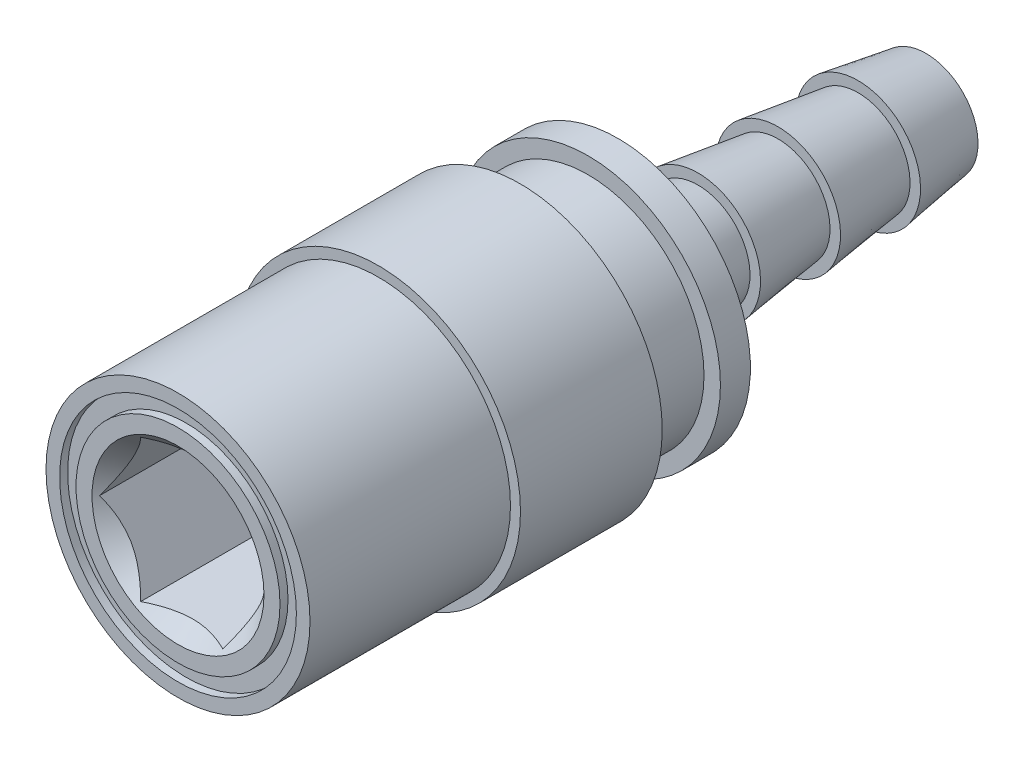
ISO-10303-21;
HEADER;
FILE_DESCRIPTION(('STEP AP214'),'2;1');
FILE_NAME('part.step','',(''),(''),'','','');
FILE_SCHEMA(('AUTOMOTIVE_DESIGN { 1 0 10303 214 1 1 1 1 }'));
ENDSEC;
DATA;
#1=APPLICATION_CONTEXT('core data for automotive mechanical design processes');
#2=APPLICATION_PROTOCOL_DEFINITION('international standard','automotive_design',2000,#1);
#3=PRODUCT_CONTEXT('',#1,'mechanical');
#4=PRODUCT('Part','Part','',(#3));
#5=PRODUCT_RELATED_PRODUCT_CATEGORY('part','',(#4));
#6=PRODUCT_DEFINITION_FORMATION('','',#4);
#7=PRODUCT_DEFINITION_CONTEXT('part definition',#1,'design');
#8=PRODUCT_DEFINITION('design','',#6,#7);
#9=PRODUCT_DEFINITION_SHAPE('','',#8);
#10=(LENGTH_UNIT() NAMED_UNIT(*) SI_UNIT(.MILLI.,.METRE.));
#11=(NAMED_UNIT(*) PLANE_ANGLE_UNIT() SI_UNIT($,.RADIAN.));
#12=(NAMED_UNIT(*) SI_UNIT($,.STERADIAN.) SOLID_ANGLE_UNIT());
#13=UNCERTAINTY_MEASURE_WITH_UNIT(LENGTH_MEASURE(1.E-05),#10,'distance_accuracy_value','');
#14=(GEOMETRIC_REPRESENTATION_CONTEXT(3) GLOBAL_UNCERTAINTY_ASSIGNED_CONTEXT((#13)) GLOBAL_UNIT_ASSIGNED_CONTEXT((#10,
#11,#12)) REPRESENTATION_CONTEXT('',''));
#15=CARTESIAN_POINT('',(0.,0.,0.));
#16=DIRECTION('',(0.,0.,1.));
#17=DIRECTION('',(1.,0.,0.));
#18=AXIS2_PLACEMENT_3D('',#15,#16,#17);
#19=CARTESIAN_POINT('',(0.,0.,0.));
#20=DIRECTION('',(0.,0.,1.));
#21=DIRECTION('',(1.,0.,0.));
#22=AXIS2_PLACEMENT_3D('',#19,#20,#21);
#23=PLANE('',#22);
#24=CARTESIAN_POINT('',(0.,0.,0.));
#25=DIRECTION('',(0.,0.,1.));
#26=DIRECTION('',(1.,0.,0.));
#27=AXIS2_PLACEMENT_3D('',#24,#25,#26);
#28=CIRCLE('',#27,5.46099999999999);
#29=CARTESIAN_POINT('',(5.46099999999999,0.,0.));
#30=VERTEX_POINT('',#29);
#31=EDGE_CURVE('E195',#30,#30,#28,.F.);
#32=ORIENTED_EDGE('',*,*,#31,.T.);
#33=EDGE_LOOP('',(#32));
#34=FACE_BOUND('',#33,.T.);
#35=CARTESIAN_POINT('',(0.,0.,0.));
#36=DIRECTION('',(0.,0.,1.));
#37=DIRECTION('',(1.,0.,0.));
#38=AXIS2_PLACEMENT_3D('',#35,#36,#37);
#39=CIRCLE('',#38,6.477);
#40=CARTESIAN_POINT('',(6.477,0.,0.));
#41=VERTEX_POINT('',#40);
#42=EDGE_CURVE('E169',#41,#41,#39,.T.);
#43=ORIENTED_EDGE('',*,*,#42,.T.);
#44=EDGE_LOOP('',(#43));
#45=FACE_BOUND('',#44,.T.);
#46=ADVANCED_FACE('F37',(#34,#45),#23,.T.);
#47=CARTESIAN_POINT('',(0.,3.30199999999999,-47.498));
#48=DIRECTION('',(0.,0.,1.));
#49=DIRECTION('',(0.,-1.,0.));
#50=AXIS2_PLACEMENT_3D('',#47,#48,#49);
#51=PLANE('',#50);
#52=CARTESIAN_POINT('',(0.,0.,-47.498));
#53=DIRECTION('',(0.,0.,1.));
#54=DIRECTION('',(0.,-1.,0.));
#55=AXIS2_PLACEMENT_3D('',#52,#53,#54);
#56=CIRCLE('',#55,3.302);
#57=CARTESIAN_POINT('',(0.,-3.30200000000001,-47.498));
#58=VERTEX_POINT('',#57);
#59=EDGE_CURVE('E153',#58,#58,#56,.T.);
#60=ORIENTED_EDGE('',*,*,#59,.F.);
#61=EDGE_LOOP('',(#60));
#62=FACE_BOUND('',#61,.T.);
#63=CARTESIAN_POINT('',(0.,0.,-47.498));
#64=DIRECTION('',(0.,0.,1.));
#65=DIRECTION('',(1.,0.,0.));
#66=AXIS2_PLACEMENT_3D('',#63,#64,#65);
#67=CIRCLE('',#66,2.3876);
#68=CARTESIAN_POINT('',(2.3876,0.,-47.498));
#69=VERTEX_POINT('',#68);
#70=EDGE_CURVE('E132',#69,#69,#67,.T.);
#71=ORIENTED_EDGE('',*,*,#70,.T.);
#72=EDGE_LOOP('',(#71));
#73=FACE_BOUND('',#72,.T.);
#74=ADVANCED_FACE('F263',(#62,#73),#51,.F.);
#75=CARTESIAN_POINT('',(0.,0.,-27.94));
#76=DIRECTION('',(0.,0.,1.));
#77=DIRECTION('',(1.,0.,0.));
#78=AXIS2_PLACEMENT_3D('',#75,#76,#77);
#79=PLANE('',#78);
#80=CARTESIAN_POINT('',(0.,0.,-27.94));
#81=DIRECTION('',(0.,0.,-1.));
#82=DIRECTION('',(-1.,0.,0.));
#83=AXIS2_PLACEMENT_3D('',#80,#81,#82);
#84=CIRCLE('',#83,8.4074);
#85=CARTESIAN_POINT('',(-8.4074,0.,-27.94));
#86=VERTEX_POINT('',#85);
#87=EDGE_CURVE('E156',#86,#86,#84,.T.);
#88=ORIENTED_EDGE('',*,*,#87,.T.);
#89=EDGE_LOOP('',(#88));
#90=FACE_BOUND('',#89,.T.);
#91=CARTESIAN_POINT('',(0.,0.,-27.94));
#92=DIRECTION('',(0.,0.,1.));
#93=DIRECTION('',(1.,0.,0.));
#94=AXIS2_PLACEMENT_3D('',#91,#92,#93);
#95=CIRCLE('',#94,3.96875);
#96=CARTESIAN_POINT('',(3.96875,0.,-27.94));
#97=VERTEX_POINT('',#96);
#98=EDGE_CURVE('E190',#97,#97,#95,.F.);
#99=ORIENTED_EDGE('',*,*,#98,.F.);
#100=EDGE_LOOP('',(#99));
#101=FACE_BOUND('',#100,.T.);
#102=ADVANCED_FACE('F266',(#90,#101),#79,.F.);
#103=CARTESIAN_POINT('',(0.,7.366,-26.035));
#104=DIRECTION('',(0.,0.,1.));
#105=DIRECTION('',(1.,0.,0.));
#106=AXIS2_PLACEMENT_3D('',#103,#104,#105);
#107=PLANE('',#106);
#108=CARTESIAN_POINT('',(0.,0.,-26.035));
#109=DIRECTION('',(0.,0.,1.));
#110=DIRECTION('',(1.,0.,0.));
#111=AXIS2_PLACEMENT_3D('',#108,#109,#110);
#112=CIRCLE('',#111,7.366);
#113=CARTESIAN_POINT('',(7.366,0.,-26.035));
#114=VERTEX_POINT('',#113);
#115=EDGE_CURVE('E179',#114,#114,#112,.T.);
#116=ORIENTED_EDGE('',*,*,#115,.F.);
#117=EDGE_LOOP('',(#116));
#118=FACE_BOUND('',#117,.T.);
#119=CARTESIAN_POINT('',(0.,0.,-26.035));
#120=DIRECTION('',(0.,0.,1.));
#121=DIRECTION('',(1.,0.,0.));
#122=AXIS2_PLACEMENT_3D('',#119,#120,#121);
#123=CIRCLE('',#122,8.4074);
#124=CARTESIAN_POINT('',(8.4074,0.,-26.035));
#125=VERTEX_POINT('',#124);
#126=EDGE_CURVE('E159',#125,#125,#123,.T.);
#127=ORIENTED_EDGE('',*,*,#126,.T.);
#128=EDGE_LOOP('',(#127));
#129=FACE_BOUND('',#128,.T.);
#130=ADVANCED_FACE('F301',(#118,#129),#107,.T.);
#131=CARTESIAN_POINT('',(0.,0.,-27.94));
#132=DIRECTION('',(0.,0.,1.));
#133=DIRECTION('',(1.,0.,0.));
#134=AXIS2_PLACEMENT_3D('',#131,#132,#133);
#135=CYLINDRICAL_SURFACE('',#134,9.017);
#136=CARTESIAN_POINT('',(0.,0.,-21.7297));
#137=DIRECTION('',(0.,0.,-1.));
#138=DIRECTION('',(-1.,0.,0.));
#139=AXIS2_PLACEMENT_3D('',#136,#137,#138);
#140=CIRCLE('',#139,9.017);
#141=CARTESIAN_POINT('',(-9.017,0.,-21.7297));
#142=VERTEX_POINT('',#141);
#143=EDGE_CURVE('E187',#142,#142,#140,.F.);
#144=ORIENTED_EDGE('',*,*,#143,.T.);
#145=EDGE_LOOP('',(#144));
#146=FACE_BOUND('',#145,.T.);
#147=CARTESIAN_POINT('',(0.,0.,-12.7297));
#148=DIRECTION('',(0.,0.,1.));
#149=DIRECTION('',(1.,0.,0.));
#150=AXIS2_PLACEMENT_3D('',#147,#148,#149);
#151=CIRCLE('',#150,9.017);
#152=CARTESIAN_POINT('',(9.017,0.,-12.7297));
#153=VERTEX_POINT('',#152);
#154=EDGE_CURVE('E160',#153,#153,#151,.T.);
#155=ORIENTED_EDGE('',*,*,#154,.F.);
#156=EDGE_LOOP('',(#155));
#157=FACE_BOUND('',#156,.T.);
#158=ADVANCED_FACE('F299',(#146,#157),#135,.T.);
#159=CARTESIAN_POINT('',(0.,7.366,-21.7297));
#160=DIRECTION('',(0.,0.,-1.));
#161=DIRECTION('',(-1.,0.,0.));
#162=AXIS2_PLACEMENT_3D('',#159,#160,#161);
#163=PLANE('',#162);
#164=ORIENTED_EDGE('',*,*,#143,.F.);
#165=EDGE_LOOP('',(#164));
#166=FACE_BOUND('',#165,.T.);
#167=CARTESIAN_POINT('',(0.,0.,-21.7297));
#168=DIRECTION('',(0.,0.,1.));
#169=DIRECTION('',(1.,0.,0.));
#170=AXIS2_PLACEMENT_3D('',#167,#168,#169);
#171=CIRCLE('',#170,7.366);
#172=CARTESIAN_POINT('',(7.366,0.,-21.7297));
#173=VERTEX_POINT('',#172);
#174=EDGE_CURVE('E184',#173,#173,#171,.T.);
#175=ORIENTED_EDGE('',*,*,#174,.T.);
#176=EDGE_LOOP('',(#175));
#177=FACE_BOUND('',#176,.T.);
#178=ADVANCED_FACE('F295',(#166,#177),#163,.T.);
#179=CARTESIAN_POINT('',(0.,0.,0.));
#180=DIRECTION('',(0.,0.,1.));
#181=DIRECTION('',(1.,0.,0.));
#182=AXIS2_PLACEMENT_3D('',#179,#180,#181);
#183=CYLINDRICAL_SURFACE('',#182,7.366);
#184=ORIENTED_EDGE('',*,*,#115,.T.);
#185=EDGE_LOOP('',(#184));
#186=FACE_BOUND('',#185,.T.);
#187=ORIENTED_EDGE('',*,*,#174,.F.);
#188=EDGE_LOOP('',(#187));
#189=FACE_BOUND('',#188,.T.);
#190=ADVANCED_FACE('F280',(#186,#189),#183,.T.);
#191=CARTESIAN_POINT('',(0.,0.,0.));
#192=DIRECTION('',(0.,0.,1.));
#193=DIRECTION('',(1.,0.,0.));
#194=AXIS2_PLACEMENT_3D('',#191,#192,#193);
#195=CYLINDRICAL_SURFACE('',#194,8.382);
#196=CARTESIAN_POINT('',(0.,0.,-12.7297));
#197=DIRECTION('',(0.,0.,1.));
#198=DIRECTION('',(1.,0.,0.));
#199=AXIS2_PLACEMENT_3D('',#196,#197,#198);
#200=CIRCLE('',#199,8.382);
#201=CARTESIAN_POINT('',(8.382,0.,-12.7297));
#202=VERTEX_POINT('',#201);
#203=EDGE_CURVE('E163',#202,#202,#200,.T.);
#204=ORIENTED_EDGE('',*,*,#203,.T.);
#205=EDGE_LOOP('',(#204));
#206=FACE_BOUND('',#205,.T.);
#207=CARTESIAN_POINT('',(0.,0.,0.));
#208=DIRECTION('',(0.,0.,1.));
#209=DIRECTION('',(1.,0.,0.));
#210=AXIS2_PLACEMENT_3D('',#207,#208,#209);
#211=CIRCLE('',#210,8.382);
#212=CARTESIAN_POINT('',(8.382,0.,0.));
#213=VERTEX_POINT('',#212);
#214=EDGE_CURVE('E166',#213,#213,#211,.T.);
#215=ORIENTED_EDGE('',*,*,#214,.F.);
#216=EDGE_LOOP('',(#215));
#217=FACE_BOUND('',#216,.T.);
#218=ADVANCED_FACE('F276',(#206,#217),#195,.T.);
#219=CARTESIAN_POINT('',(0.,9.017,-12.7297));
#220=DIRECTION('',(0.,0.,1.));
#221=DIRECTION('',(1.,0.,0.));
#222=AXIS2_PLACEMENT_3D('',#219,#220,#221);
#223=PLANE('',#222);
#224=ORIENTED_EDGE('',*,*,#154,.T.);
#225=EDGE_LOOP('',(#224));
#226=FACE_BOUND('',#225,.T.);
#227=ORIENTED_EDGE('',*,*,#203,.F.);
#228=EDGE_LOOP('',(#227));
#229=FACE_BOUND('',#228,.T.);
#230=ADVANCED_FACE('F272',(#226,#229),#223,.T.);
#231=CARTESIAN_POINT('',(0.,0.,-0.508));
#232=DIRECTION('',(0.,0.,1.));
#233=DIRECTION('',(1.,0.,0.));
#234=AXIS2_PLACEMENT_3D('',#231,#232,#233);
#235=CYLINDRICAL_SURFACE('',#234,6.477);
#236=CARTESIAN_POINT('',(0.,0.,-0.508));
#237=DIRECTION('',(0.,0.,1.));
#238=DIRECTION('',(1.,0.,0.));
#239=AXIS2_PLACEMENT_3D('',#236,#237,#238);
#240=CIRCLE('',#239,6.477);
#241=CARTESIAN_POINT('',(6.477,0.,-0.508));
#242=VERTEX_POINT('',#241);
#243=EDGE_CURVE('E170',#242,#242,#240,.T.);
#244=ORIENTED_EDGE('',*,*,#243,.T.);
#245=EDGE_LOOP('',(#244));
#246=FACE_BOUND('',#245,.T.);
#247=ORIENTED_EDGE('',*,*,#42,.F.);
#248=EDGE_LOOP('',(#247));
#249=FACE_BOUND('',#248,.T.);
#250=ADVANCED_FACE('F275',(#246,#249),#235,.T.);
#251=CARTESIAN_POINT('',(0.,0.,-0.508));
#252=DIRECTION('',(0.,0.,1.));
#253=DIRECTION('',(1.,0.,0.));
#254=AXIS2_PLACEMENT_3D('',#251,#252,#253);
#255=PLANE('',#254);
#256=ORIENTED_EDGE('',*,*,#243,.F.);
#257=EDGE_LOOP('',(#256));
#258=FACE_BOUND('',#257,.T.);
#259=CARTESIAN_POINT('',(0.,0.,-0.508));
#260=DIRECTION('',(0.,0.,1.));
#261=DIRECTION('',(1.,0.,0.));
#262=AXIS2_PLACEMENT_3D('',#259,#260,#261);
#263=CIRCLE('',#262,7.517);
#264=CARTESIAN_POINT('',(7.517,0.,-0.508));
#265=VERTEX_POINT('',#264);
#266=EDGE_CURVE('E176',#265,#265,#263,.T.);
#267=ORIENTED_EDGE('',*,*,#266,.T.);
#268=EDGE_LOOP('',(#267));
#269=FACE_BOUND('',#268,.T.);
#270=ADVANCED_FACE('F284',(#258,#269),#255,.T.);
#271=CARTESIAN_POINT('',(0.,0.,-0.508));
#272=DIRECTION('',(0.,0.,1.));
#273=DIRECTION('',(1.,0.,0.));
#274=AXIS2_PLACEMENT_3D('',#271,#272,#273);
#275=CYLINDRICAL_SURFACE('',#274,7.517);
#276=ORIENTED_EDGE('',*,*,#266,.F.);
#277=EDGE_LOOP('',(#276));
#278=FACE_BOUND('',#277,.T.);
#279=CARTESIAN_POINT('',(0.,0.,0.));
#280=DIRECTION('',(0.,0.,1.));
#281=DIRECTION('',(1.,0.,0.));
#282=AXIS2_PLACEMENT_3D('',#279,#280,#281);
#283=CIRCLE('',#282,7.517);
#284=CARTESIAN_POINT('',(7.517,0.,0.));
#285=VERTEX_POINT('',#284);
#286=EDGE_CURVE('E173',#285,#285,#283,.T.);
#287=ORIENTED_EDGE('',*,*,#286,.T.);
#288=EDGE_LOOP('',(#287));
#289=FACE_BOUND('',#288,.T.);
#290=ADVANCED_FACE('F288',(#278,#289),#275,.F.);
#291=ORIENTED_EDGE('',*,*,#286,.F.);
#292=EDGE_LOOP('',(#291));
#293=FACE_BOUND('',#292,.T.);
#294=ORIENTED_EDGE('',*,*,#214,.T.);
#295=EDGE_LOOP('',(#294));
#296=FACE_BOUND('',#295,.T.);
#297=ADVANCED_FACE('F270',(#293,#296),#23,.T.);
#298=CARTESIAN_POINT('',(0.,0.,-25.4));
#299=DIRECTION('',(0.,0.,-1.));
#300=DIRECTION('',(-1.,0.,0.));
#301=AXIS2_PLACEMENT_3D('',#298,#299,#300);
#302=CYLINDRICAL_SURFACE('',#301,8.4074);
#303=ORIENTED_EDGE('',*,*,#126,.F.);
#304=EDGE_LOOP('',(#303));
#305=FACE_BOUND('',#304,.T.);
#306=ORIENTED_EDGE('',*,*,#87,.F.);
#307=EDGE_LOOP('',(#306));
#308=FACE_BOUND('',#307,.T.);
#309=ADVANCED_FACE('F261',(#305,#308),#302,.T.);
#310=CARTESIAN_POINT('',(0.,0.,-47.498));
#311=DIRECTION('',(0.,0.,1.));
#312=DIRECTION('',(0.,-1.,0.));
#313=AXIS2_PLACEMENT_3D('',#310,#311,#312);
#314=CONICAL_SURFACE('',#313,3.302,0.153201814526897);
#315=CARTESIAN_POINT('',(0.,0.,-43.18));
#316=DIRECTION('',(0.,0.,1.));
#317=DIRECTION('',(0.,-1.,0.));
#318=AXIS2_PLACEMENT_3D('',#315,#316,#317);
#319=CIRCLE('',#318,3.96875);
#320=CARTESIAN_POINT('',(0.,-3.96875000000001,-43.18));
#321=VERTEX_POINT('',#320);
#322=EDGE_CURVE('E150',#321,#321,#319,.T.);
#323=ORIENTED_EDGE('',*,*,#322,.F.);
#324=EDGE_LOOP('',(#323));
#325=FACE_BOUND('',#324,.T.);
#326=ORIENTED_EDGE('',*,*,#59,.T.);
#327=EDGE_LOOP('',(#326));
#328=FACE_BOUND('',#327,.T.);
#329=ADVANCED_FACE('F257',(#325,#328),#314,.T.);
#330=CARTESIAN_POINT('',(0.,3.96874999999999,-43.18));
#331=DIRECTION('',(0.,0.,-1.));
#332=DIRECTION('',(0.,1.,0.));
#333=AXIS2_PLACEMENT_3D('',#330,#331,#332);
#334=PLANE('',#333);
#335=CARTESIAN_POINT('',(0.,0.,-43.18));
#336=DIRECTION('',(0.,0.,1.));
#337=DIRECTION('',(0.,-1.,0.));
#338=AXIS2_PLACEMENT_3D('',#335,#336,#337);
#339=CIRCLE('',#338,3.302);
#340=CARTESIAN_POINT('',(0.,-3.30200000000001,-43.18));
#341=VERTEX_POINT('',#340);
#342=EDGE_CURVE('E147',#341,#341,#339,.T.);
#343=ORIENTED_EDGE('',*,*,#342,.F.);
#344=EDGE_LOOP('',(#343));
#345=FACE_BOUND('',#344,.T.);
#346=ORIENTED_EDGE('',*,*,#322,.T.);
#347=EDGE_LOOP('',(#346));
#348=FACE_BOUND('',#347,.T.);
#349=ADVANCED_FACE('F253',(#345,#348),#334,.F.);
#350=CARTESIAN_POINT('',(0.,0.,-43.18));
#351=DIRECTION('',(0.,0.,1.));
#352=DIRECTION('',(0.,-1.,0.));
#353=AXIS2_PLACEMENT_3D('',#350,#351,#352);
#354=CONICAL_SURFACE('',#353,3.302,0.130504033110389);
#355=CARTESIAN_POINT('',(0.,0.,-38.1));
#356=DIRECTION('',(0.,0.,1.));
#357=DIRECTION('',(0.,-1.,0.));
#358=AXIS2_PLACEMENT_3D('',#355,#356,#357);
#359=CIRCLE('',#358,3.96875);
#360=CARTESIAN_POINT('',(0.,-3.96875000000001,-38.1));
#361=VERTEX_POINT('',#360);
#362=EDGE_CURVE('E144',#361,#361,#359,.T.);
#363=ORIENTED_EDGE('',*,*,#362,.F.);
#364=EDGE_LOOP('',(#363));
#365=FACE_BOUND('',#364,.T.);
#366=ORIENTED_EDGE('',*,*,#342,.T.);
#367=EDGE_LOOP('',(#366));
#368=FACE_BOUND('',#367,.T.);
#369=ADVANCED_FACE('F249',(#365,#368),#354,.T.);
#370=CARTESIAN_POINT('',(0.,3.96874999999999,-38.1));
#371=DIRECTION('',(0.,0.,-1.));
#372=DIRECTION('',(0.,1.,0.));
#373=AXIS2_PLACEMENT_3D('',#370,#371,#372);
#374=PLANE('',#373);
#375=CARTESIAN_POINT('',(0.,0.,-38.1));
#376=DIRECTION('',(0.,0.,1.));
#377=DIRECTION('',(0.,-1.,0.));
#378=AXIS2_PLACEMENT_3D('',#375,#376,#377);
#379=CIRCLE('',#378,3.302);
#380=CARTESIAN_POINT('',(0.,-3.30200000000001,-38.1));
#381=VERTEX_POINT('',#380);
#382=EDGE_CURVE('E141',#381,#381,#379,.T.);
#383=ORIENTED_EDGE('',*,*,#382,.F.);
#384=EDGE_LOOP('',(#383));
#385=FACE_BOUND('',#384,.T.);
#386=ORIENTED_EDGE('',*,*,#362,.T.);
#387=EDGE_LOOP('',(#386));
#388=FACE_BOUND('',#387,.T.);
#389=ADVANCED_FACE('F245',(#385,#388),#374,.F.);
#390=CARTESIAN_POINT('',(0.,0.,-38.1));
#391=DIRECTION('',(0.,0.,1.));
#392=DIRECTION('',(0.,-1.,0.));
#393=AXIS2_PLACEMENT_3D('',#390,#391,#392);
#394=CONICAL_SURFACE('',#393,3.302,0.130504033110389);
#395=CARTESIAN_POINT('',(0.,0.,-33.02));
#396=DIRECTION('',(0.,0.,1.));
#397=DIRECTION('',(0.,-1.,0.));
#398=AXIS2_PLACEMENT_3D('',#395,#396,#397);
#399=CIRCLE('',#398,3.96875);
#400=CARTESIAN_POINT('',(0.,-3.96875000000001,-33.02));
#401=VERTEX_POINT('',#400);
#402=EDGE_CURVE('E138',#401,#401,#399,.T.);
#403=ORIENTED_EDGE('',*,*,#402,.F.);
#404=EDGE_LOOP('',(#403));
#405=FACE_BOUND('',#404,.T.);
#406=ORIENTED_EDGE('',*,*,#382,.T.);
#407=EDGE_LOOP('',(#406));
#408=FACE_BOUND('',#407,.T.);
#409=ADVANCED_FACE('F241',(#405,#408),#394,.T.);
#410=CARTESIAN_POINT('',(0.,3.96874999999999,-33.02));
#411=DIRECTION('',(0.,0.,-1.));
#412=DIRECTION('',(0.,1.,0.));
#413=AXIS2_PLACEMENT_3D('',#410,#411,#412);
#414=PLANE('',#413);
#415=CARTESIAN_POINT('',(0.,0.,-33.02));
#416=DIRECTION('',(0.,0.,1.));
#417=DIRECTION('',(0.,-1.,0.));
#418=AXIS2_PLACEMENT_3D('',#415,#416,#417);
#419=CIRCLE('',#418,3.302);
#420=CARTESIAN_POINT('',(0.,-3.30200000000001,-33.02));
#421=VERTEX_POINT('',#420);
#422=EDGE_CURVE('E135',#421,#421,#419,.T.);
#423=ORIENTED_EDGE('',*,*,#422,.F.);
#424=EDGE_LOOP('',(#423));
#425=FACE_BOUND('',#424,.T.);
#426=ORIENTED_EDGE('',*,*,#402,.T.);
#427=EDGE_LOOP('',(#426));
#428=FACE_BOUND('',#427,.T.);
#429=ADVANCED_FACE('F237',(#425,#428),#414,.F.);
#430=CARTESIAN_POINT('',(0.,0.,-33.02));
#431=DIRECTION('',(0.,0.,1.));
#432=DIRECTION('',(0.,-1.,0.));
#433=AXIS2_PLACEMENT_3D('',#430,#431,#432);
#434=CONICAL_SURFACE('',#433,3.302,0.130504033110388);
#435=ORIENTED_EDGE('',*,*,#98,.T.);
#436=EDGE_LOOP('',(#435));
#437=FACE_BOUND('',#436,.T.);
#438=ORIENTED_EDGE('',*,*,#422,.T.);
#439=EDGE_LOOP('',(#438));
#440=FACE_BOUND('',#439,.T.);
#441=ADVANCED_FACE('F233',(#437,#440),#434,.T.);
#442=CARTESIAN_POINT('',(0.,0.,3.94777119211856));
#443=DIRECTION('',(0.,0.,1.));
#444=DIRECTION('',(1.,0.,0.));
#445=AXIS2_PLACEMENT_3D('',#442,#443,#444);
#446=CYLINDRICAL_SURFACE('',#445,2.3876);
#447=CARTESIAN_POINT('',(0.,0.,-26.035));
#448=DIRECTION('',(0.,0.,1.));
#449=DIRECTION('',(1.,0.,0.));
#450=AXIS2_PLACEMENT_3D('',#447,#448,#449);
#451=CIRCLE('',#450,2.3876);
#452=CARTESIAN_POINT('',(2.3876,0.,-26.035));
#453=VERTEX_POINT('',#452);
#454=EDGE_CURVE('E129',#453,#453,#451,.T.);
#455=ORIENTED_EDGE('',*,*,#454,.T.);
#456=EDGE_LOOP('',(#455));
#457=FACE_BOUND('',#456,.T.);
#458=ORIENTED_EDGE('',*,*,#70,.F.);
#459=EDGE_LOOP('',(#458));
#460=FACE_BOUND('',#459,.T.);
#461=ADVANCED_FACE('F229',(#457,#460),#446,.F.);
#462=CARTESIAN_POINT('',(0.,3.96875,-26.035));
#463=DIRECTION('',(0.,0.,1.));
#464=DIRECTION('',(1.,0.,0.));
#465=AXIS2_PLACEMENT_3D('',#462,#463,#464);
#466=PLANE('',#465);
#467=CARTESIAN_POINT('',(0.,0.,-26.035));
#468=DIRECTION('',(0.,0.,1.));
#469=DIRECTION('',(1.,0.,0.));
#470=AXIS2_PLACEMENT_3D('',#467,#468,#469);
#471=CIRCLE('',#470,3.96875);
#472=CARTESIAN_POINT('',(3.96875,0.,-26.035));
#473=VERTEX_POINT('',#472);
#474=EDGE_CURVE('E121',#473,#473,#471,.T.);
#475=ORIENTED_EDGE('',*,*,#474,.T.);
#476=EDGE_LOOP('',(#475));
#477=FACE_BOUND('',#476,.T.);
#478=ORIENTED_EDGE('',*,*,#454,.F.);
#479=EDGE_LOOP('',(#478));
#480=FACE_BOUND('',#479,.T.);
#481=ADVANCED_FACE('F225',(#477,#480),#466,.T.);
#482=CARTESIAN_POINT('',(0.,0.,3.94777119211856));
#483=DIRECTION('',(0.,0.,1.));
#484=DIRECTION('',(1.,0.,0.));
#485=AXIS2_PLACEMENT_3D('',#482,#483,#484);
#486=CYLINDRICAL_SURFACE('',#485,3.96875);
#487=CARTESIAN_POINT('',(0.,0.,-12.7297));
#488=DIRECTION('',(0.,0.,1.));
#489=DIRECTION('',(1.,0.,0.));
#490=AXIS2_PLACEMENT_3D('',#487,#488,#489);
#491=CIRCLE('',#490,3.96875);
#492=CARTESIAN_POINT('',(3.96875,0.,-12.7297));
#493=VERTEX_POINT('',#492);
#494=EDGE_CURVE('E118',#493,#493,#491,.T.);
#495=ORIENTED_EDGE('',*,*,#494,.T.);
#496=EDGE_LOOP('',(#495));
#497=FACE_BOUND('',#496,.T.);
#498=ORIENTED_EDGE('',*,*,#474,.F.);
#499=EDGE_LOOP('',(#498));
#500=FACE_BOUND('',#499,.T.);
#501=ADVANCED_FACE('F221',(#497,#500),#486,.F.);
#502=CARTESIAN_POINT('',(0.,4.445,-12.7297));
#503=DIRECTION('',(0.,0.,1.));
#504=DIRECTION('',(1.,0.,0.));
#505=AXIS2_PLACEMENT_3D('',#502,#503,#504);
#506=PLANE('',#505);
#507=ORIENTED_EDGE('',*,*,#494,.F.);
#508=EDGE_LOOP('',(#507));
#509=FACE_BOUND('',#508,.T.);
#510=DIRECTION('',(1.,0.,0.));
#511=VECTOR('',#510,1.);
#512=CARTESIAN_POINT('',(2.61031603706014,4.5212,-12.7297));
#513=LINE('',#512,#511);
#514=CARTESIAN_POINT('',(-2.61031603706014,4.5212,-12.7297));
#515=VERTEX_POINT('',#514);
#516=CARTESIAN_POINT('',(2.61031603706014,4.5212,-12.7297));
#517=VERTEX_POINT('',#516);
#518=EDGE_CURVE('E117',#515,#517,#513,.T.);
#519=ORIENTED_EDGE('',*,*,#518,.F.);
#520=DIRECTION('',(0.5,0.866025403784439,0.));
#521=VECTOR('',#520,1.);
#522=CARTESIAN_POINT('',(-2.61031603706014,4.5212,-12.7297));
#523=LINE('',#522,#521);
#524=CARTESIAN_POINT('',(-5.22063207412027,0.,-12.7297));
#525=VERTEX_POINT('',#524);
#526=EDGE_CURVE('E110',#525,#515,#523,.T.);
#527=ORIENTED_EDGE('',*,*,#526,.F.);
#528=DIRECTION('',(-0.5,0.866025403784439,0.));
#529=VECTOR('',#528,1.);
#530=CARTESIAN_POINT('',(-5.22063207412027,0.,-12.7297));
#531=LINE('',#530,#529);
#532=CARTESIAN_POINT('',(-2.61031603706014,-4.5212,-12.7297));
#533=VERTEX_POINT('',#532);
#534=EDGE_CURVE('E96',#533,#525,#531,.T.);
#535=ORIENTED_EDGE('',*,*,#534,.F.);
#536=DIRECTION('',(-1.,0.,0.));
#537=VECTOR('',#536,1.);
#538=CARTESIAN_POINT('',(-2.61031603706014,-4.5212,-12.7297));
#539=LINE('',#538,#537);
#540=CARTESIAN_POINT('',(2.61031603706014,-4.5212,-12.7297));
#541=VERTEX_POINT('',#540);
#542=EDGE_CURVE('E106',#541,#533,#539,.T.);
#543=ORIENTED_EDGE('',*,*,#542,.F.);
#544=DIRECTION('',(-0.5,-0.866025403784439,0.));
#545=VECTOR('',#544,1.);
#546=CARTESIAN_POINT('',(2.61031603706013,-4.5212,-12.7297));
#547=LINE('',#546,#545);
#548=CARTESIAN_POINT('',(5.22063207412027,0.,-12.7297));
#549=VERTEX_POINT('',#548);
#550=EDGE_CURVE('E572',#549,#541,#547,.T.);
#551=ORIENTED_EDGE('',*,*,#550,.F.);
#552=DIRECTION('',(0.5,-0.866025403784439,0.));
#553=VECTOR('',#552,1.);
#554=CARTESIAN_POINT('',(5.22063207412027,0.,-12.7297));
#555=LINE('',#554,#553);
#556=EDGE_CURVE('E123',#517,#549,#555,.T.);
#557=ORIENTED_EDGE('',*,*,#556,.F.);
#558=EDGE_LOOP('',(#519,#527,#535,#543,#551,#557));
#559=FACE_BOUND('',#558,.T.);
#560=ADVANCED_FACE('F115',(#509,#559),#506,.T.);
#561=CARTESIAN_POINT('',(0.,0.,-1.01599999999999));
#562=DIRECTION('',(0.,0.,1.));
#563=DIRECTION('',(1.,0.,0.));
#564=AXIS2_PLACEMENT_3D('',#561,#562,#563);
#565=CONICAL_SURFACE('',#564,4.445,0.785398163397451);
#566=CARTESIAN_POINT('',(-5.51401409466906,4.5212,1.66961013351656));
#567=CARTESIAN_POINT('',(-5.38105042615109,4.5212,1.56681394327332));
#568=CARTESIAN_POINT('',(-5.2473779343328,4.5212,1.46492032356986));
#569=CARTESIAN_POINT('',(-4.97832290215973,4.5212,1.26335276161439));
#570=CARTESIAN_POINT('',(-4.84293997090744,4.5212,1.16367934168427));
#571=CARTESIAN_POINT('',(-4.56918322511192,4.5212,0.966257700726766));
#572=CARTESIAN_POINT('',(-4.43079440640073,4.5212,0.868530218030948));
#573=CARTESIAN_POINT('',(-4.15172683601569,4.5212,0.676412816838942));
#574=CARTESIAN_POINT('',(-4.01104824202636,4.5212,0.582022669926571));
#575=CARTESIAN_POINT('',(-3.7177576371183,4.5212,0.391328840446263));
#576=CARTESIAN_POINT('',(-3.56496528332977,4.5212,0.295301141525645));
#577=CARTESIAN_POINT('',(-3.25578846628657,4.5212,0.109113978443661));
#578=CARTESIAN_POINT('',(-3.09940339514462,4.5212,0.0189555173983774));
#579=CARTESIAN_POINT('',(-2.78298293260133,4.5212,-0.153580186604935));
#580=CARTESIAN_POINT('',(-2.62296008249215,4.5212,-0.235980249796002));
#581=CARTESIAN_POINT('',(-2.29834947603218,4.5212,-0.391152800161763));
#582=CARTESIAN_POINT('',(-2.13376394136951,4.5212,-0.463929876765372));
#583=CARTESIAN_POINT('',(-1.81689806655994,4.5212,-0.590320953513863));
#584=CARTESIAN_POINT('',(-1.6651024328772,4.5212,-0.645137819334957));
#585=CARTESIAN_POINT('',(-1.35758701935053,4.5212,-0.742626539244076));
#586=CARTESIAN_POINT('',(-1.20186699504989,4.5212,-0.785297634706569));
#587=CARTESIAN_POINT('',(-0.890179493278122,4.5212,-0.855449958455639));
#588=CARTESIAN_POINT('',(-0.734276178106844,4.5212,-0.883211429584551));
#589=CARTESIAN_POINT('',(-0.420459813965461,4.5212,-0.922955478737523));
#590=CARTESIAN_POINT('',(-0.262547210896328,4.5212,-0.934941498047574));
#591=CARTESIAN_POINT('',(0.046404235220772,4.5212,-0.942078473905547));
#592=CARTESIAN_POINT('',(0.197425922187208,4.5212,-0.937976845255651));
#593=CARTESIAN_POINT('',(0.498320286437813,4.5212,-0.914896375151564));
#594=CARTESIAN_POINT('',(0.648192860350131,4.5212,-0.895916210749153));
#595=CARTESIAN_POINT('',(0.948246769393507,4.5212,-0.843839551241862));
#596=CARTESIAN_POINT('',(1.09838365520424,4.5212,-0.810491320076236));
#597=CARTESIAN_POINT('',(1.39534010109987,4.5212,-0.731548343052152));
#598=CARTESIAN_POINT('',(1.54215982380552,4.5212,-0.685954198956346));
#599=CARTESIAN_POINT('',(1.83929158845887,4.5212,-0.582074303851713));
#600=CARTESIAN_POINT('',(1.98942242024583,4.5212,-0.523276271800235));
#601=CARTESIAN_POINT('',(2.28583011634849,4.5212,-0.396584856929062));
#602=CARTESIAN_POINT('',(2.43210522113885,4.5212,-0.328687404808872));
#603=CARTESIAN_POINT('',(2.72148701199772,4.5212,-0.185406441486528));
#604=CARTESIAN_POINT('',(2.86458224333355,4.5212,-0.109999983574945));
#605=CARTESIAN_POINT('',(3.14749666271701,4.5212,0.0466412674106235));
#606=CARTESIAN_POINT('',(3.28731634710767,4.5212,0.127875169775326));
#607=CARTESIAN_POINT('',(3.55728104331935,4.5212,0.290913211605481));
#608=CARTESIAN_POINT('',(3.68756310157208,4.5212,0.372491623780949));
#609=CARTESIAN_POINT('',(3.94588860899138,4.5212,0.539129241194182));
#610=CARTESIAN_POINT('',(4.0739318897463,4.5212,0.624188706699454));
#611=CARTESIAN_POINT('',(4.32704540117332,4.5212,0.796477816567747));
#612=CARTESIAN_POINT('',(4.45213122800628,4.5212,0.883684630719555));
#613=CARTESIAN_POINT('',(4.70058560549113,4.5212,1.06044233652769));
#614=CARTESIAN_POINT('',(4.82395462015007,4.5212,1.14999257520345));
#615=CARTESIAN_POINT('',(4.94660319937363,4.5212,1.24050226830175));
#616=B_SPLINE_CURVE_WITH_KNOTS('',3,(#566,#567,#568,#569,#570,#571,#572,#573,#574,#575,#576,
#577,#578,#579,#580,#581,#582,#583,#584,#585,#586,#587,#588,#589,#590,#591,#592,#593,#594,#595,
#596,#597,#598,#599,#600,#601,#602,#603,#604,#605,#606,#607,#608,#609,#610,#611,#612,#613,#614,
#615),.UNSPECIFIED.,.F.,.F.,(4,2,2,2,2,2,2,2,2,2,2,2,2,2,2,2,2,2,2,2,2,2,2,2,4),(0.,
0.504208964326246,1.00853532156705,1.51674567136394,2.02492117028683,2.56620476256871,
3.10758062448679,3.64731081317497,4.18678265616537,4.67053802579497,5.15432360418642,
5.62866584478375,6.10290459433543,6.55537766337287,7.00789096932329,7.46867729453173,
7.92944098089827,8.41277445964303,8.89632481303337,9.38140104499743,9.86640329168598,
10.3274849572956,10.7886011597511,11.2460251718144,11.7033230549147),.UNSPECIFIED.);
#617=CARTESIAN_POINT('',(2.61031603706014,4.5212,-0.240367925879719));
#618=VERTEX_POINT('',#617);
#619=CARTESIAN_POINT('',(-2.61031603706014,4.5212,-0.240367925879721));
#620=VERTEX_POINT('',#619);
#621=EDGE_CURVE('E13',#618,#620,#616,.F.);
#622=ORIENTED_EDGE('',*,*,#621,.F.);
#623=CARTESIAN_POINT('',(5.22074754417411,-0.000199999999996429,-0.240252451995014));
#624=CARTESIAN_POINT('',(5.17586399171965,0.0775405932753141,-0.285132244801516));
#625=CARTESIAN_POINT('',(5.13063543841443,0.155878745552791,-0.32863477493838));
#626=CARTESIAN_POINT('',(5.03942064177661,0.313867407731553,-0.412466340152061));
#627=CARTESIAN_POINT('',(4.99343400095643,0.393518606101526,-0.452793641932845));
#628=CARTESIAN_POINT('',(4.85380815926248,0.635357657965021,-0.5687281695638));
#629=CARTESIAN_POINT('',(4.7589869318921,0.799592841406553,-0.638793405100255));
#630=CARTESIAN_POINT('',(4.56777232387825,1.13078625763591,-0.758775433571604));
#631=CARTESIAN_POINT('',(4.47142782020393,1.29765983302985,-0.808994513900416));
#632=CARTESIAN_POINT('',(4.32532706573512,1.55071376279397,-0.867085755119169));
#633=CARTESIAN_POINT('',(4.27641170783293,1.63543764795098,-0.883568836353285));
#634=CARTESIAN_POINT('',(4.17816680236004,1.80560281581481,-0.91041619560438));
#635=CARTESIAN_POINT('',(4.12883731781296,1.89104398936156,-0.920781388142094));
#636=CARTESIAN_POINT('',(4.00862971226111,2.09924966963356,-0.938159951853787));
#637=CARTESIAN_POINT('',(3.93762207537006,2.22223850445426,-0.941806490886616));
#638=CARTESIAN_POINT('',(3.79573476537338,2.46799453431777,-0.93568722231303));
#639=CARTESIAN_POINT('',(3.72485514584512,2.59076163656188,-0.925916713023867));
#640=CARTESIAN_POINT('',(3.58376412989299,2.83513844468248,-0.893539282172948));
#641=CARTESIAN_POINT('',(3.51355357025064,2.95674670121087,-0.870918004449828));
#642=CARTESIAN_POINT('',(3.374339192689,3.1978730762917,-0.814068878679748));
#643=CARTESIAN_POINT('',(3.30533528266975,3.31739135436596,-0.779841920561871));
#644=CARTESIAN_POINT('',(3.1828379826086,3.52956290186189,-0.709424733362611));
#645=CARTESIAN_POINT('',(3.12907340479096,3.62268588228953,-0.675086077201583));
#646=CARTESIAN_POINT('',(3.02250943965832,3.80726008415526,-0.600874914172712));
#647=CARTESIAN_POINT('',(2.96971008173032,3.89871125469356,-0.561002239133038));
#648=CARTESIAN_POINT('',(2.86524285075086,4.07965380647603,-0.476616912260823));
#649=CARTESIAN_POINT('',(2.81357200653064,4.16915033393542,-0.432118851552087));
#650=CARTESIAN_POINT('',(2.71118717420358,4.34648606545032,-0.339067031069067));
#651=CARTESIAN_POINT('',(2.66047262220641,4.4343262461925,-0.29051575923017));
#652=CARTESIAN_POINT('',(2.6102005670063,4.5214,-0.240252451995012));
#653=B_SPLINE_CURVE_WITH_KNOTS('',3,(#623,#624,#625,#626,#627,#628,#629,#630,#631,#632,#633,
#634,#635,#636,#637,#638,#639,#640,#641,#642,#643,#644,#645,#646,#647,#648,#649,#650,#651,#652),
.UNSPECIFIED.,.F.,.F.,(4,2,2,2,2,2,2,2,2,2,2,2,2,2,4),(0.,0.301065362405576,0.602293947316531,
1.20800348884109,1.80409440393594,2.10155521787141,2.39897155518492,2.82449561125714,
3.25016882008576,3.67631850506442,4.1024355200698,4.44091353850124,4.77940184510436,
5.11685303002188,5.45409858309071),.UNSPECIFIED.);
#654=CARTESIAN_POINT('',(5.22063207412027,0.,-0.240367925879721));
#655=VERTEX_POINT('',#654);
#656=EDGE_CURVE('E50',#655,#618,#653,.T.);
#657=ORIENTED_EDGE('',*,*,#656,.F.);
#658=CARTESIAN_POINT('',(2.6102005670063,-4.5214,-0.240252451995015));
#659=CARTESIAN_POINT('',(2.65508411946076,-4.44365940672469,-0.285132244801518));
#660=CARTESIAN_POINT('',(2.70031267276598,-4.36532125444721,-0.328634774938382));
#661=CARTESIAN_POINT('',(2.79152746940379,-4.20733259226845,-0.412466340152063));
#662=CARTESIAN_POINT('',(2.83751411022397,-4.12768139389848,-0.452793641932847));
#663=CARTESIAN_POINT('',(2.97713995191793,-3.88584234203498,-0.568728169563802));
#664=CARTESIAN_POINT('',(3.0719611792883,-3.72160715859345,-0.638793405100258));
#665=CARTESIAN_POINT('',(3.26317578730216,-3.39041374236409,-0.758775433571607));
#666=CARTESIAN_POINT('',(3.35952029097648,-3.22354016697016,-0.808994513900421));
#667=CARTESIAN_POINT('',(3.50562104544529,-2.97048623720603,-0.867085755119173));
#668=CARTESIAN_POINT('',(3.55453640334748,-2.88576235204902,-0.883568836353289));
#669=CARTESIAN_POINT('',(3.65278130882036,-2.71559718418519,-0.910416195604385));
#670=CARTESIAN_POINT('',(3.70211079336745,-2.63015601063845,-0.920781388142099));
#671=CARTESIAN_POINT('',(3.8223183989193,-2.42195033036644,-0.938159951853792));
#672=CARTESIAN_POINT('',(3.89332603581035,-2.29896149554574,-0.941806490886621));
#673=CARTESIAN_POINT('',(4.03521334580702,-2.05320546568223,-0.935687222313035));
#674=CARTESIAN_POINT('',(4.10609296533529,-1.93043836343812,-0.925916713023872));
#675=CARTESIAN_POINT('',(4.24718398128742,-1.68606155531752,-0.893539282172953));
#676=CARTESIAN_POINT('',(4.31739454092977,-1.56445329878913,-0.870918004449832));
#677=CARTESIAN_POINT('',(4.4566089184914,-1.3233269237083,-0.814068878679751));
#678=CARTESIAN_POINT('',(4.52561282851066,-1.20380864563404,-0.779841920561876));
#679=CARTESIAN_POINT('',(4.64811012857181,-0.991637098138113,-0.709424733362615));
#680=CARTESIAN_POINT('',(4.70187470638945,-0.898514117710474,-0.675086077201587));
#681=CARTESIAN_POINT('',(4.80843867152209,-0.713939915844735,-0.600874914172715));
#682=CARTESIAN_POINT('',(4.86123802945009,-0.622488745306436,-0.56100223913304));
#683=CARTESIAN_POINT('',(4.96570526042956,-0.441546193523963,-0.476616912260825));
#684=CARTESIAN_POINT('',(5.01737610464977,-0.352049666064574,-0.432118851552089));
#685=CARTESIAN_POINT('',(5.11976093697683,-0.17471393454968,-0.33906703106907));
#686=CARTESIAN_POINT('',(5.170475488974,-0.0868737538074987,-0.290515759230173));
#687=CARTESIAN_POINT('',(5.22074754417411,0.000200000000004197,-0.240252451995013));
#688=B_SPLINE_CURVE_WITH_KNOTS('',3,(#658,#659,#660,#661,#662,#663,#664,#665,#666,#667,#668,
#669,#670,#671,#672,#673,#674,#675,#676,#677,#678,#679,#680,#681,#682,#683,#684,#685,#686,#687),
.UNSPECIFIED.,.F.,.F.,(4,2,2,2,2,2,2,2,2,2,2,2,2,2,4),(0.,0.301065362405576,0.602293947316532,
1.20800348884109,1.80409440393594,2.10155521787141,2.39897155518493,2.82449561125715,
3.25016882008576,3.67631850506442,4.1024355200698,4.44091353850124,4.77940184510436,
5.11685303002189,5.45409858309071),.UNSPECIFIED.);
#689=CARTESIAN_POINT('',(2.61031603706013,-4.5212,-0.240367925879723));
#690=VERTEX_POINT('',#689);
#691=EDGE_CURVE('E343',#690,#655,#688,.T.);
#692=ORIENTED_EDGE('',*,*,#691,.F.);
#693=CARTESIAN_POINT('',(-5.51401409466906,-4.5212,1.66961013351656));
#694=CARTESIAN_POINT('',(-5.3810504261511,-4.5212,1.56681394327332));
#695=CARTESIAN_POINT('',(-5.24737793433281,-4.5212,1.46492032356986));
#696=CARTESIAN_POINT('',(-4.97832290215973,-4.5212,1.26335276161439));
#697=CARTESIAN_POINT('',(-4.84293997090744,-4.5212,1.16367934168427));
#698=CARTESIAN_POINT('',(-4.56918322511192,-4.5212,0.966257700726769));
#699=CARTESIAN_POINT('',(-4.43079440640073,-4.5212,0.86853021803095));
#700=CARTESIAN_POINT('',(-4.1517268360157,-4.5212,0.676412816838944));
#701=CARTESIAN_POINT('',(-4.01104824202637,-4.5212,0.582022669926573));
#702=CARTESIAN_POINT('',(-3.71775763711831,-4.5212,0.391328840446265));
#703=CARTESIAN_POINT('',(-3.56496528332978,-4.5212,0.295301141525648));
#704=CARTESIAN_POINT('',(-3.25578846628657,-4.5212,0.109113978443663));
#705=CARTESIAN_POINT('',(-3.09940339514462,-4.5212,0.0189555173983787));
#706=CARTESIAN_POINT('',(-2.78298293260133,-4.5212,-0.153580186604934));
#707=CARTESIAN_POINT('',(-2.62296008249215,-4.5212,-0.235980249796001));
#708=CARTESIAN_POINT('',(-2.29834947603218,-4.5212,-0.391152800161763));
#709=CARTESIAN_POINT('',(-2.13376394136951,-4.5212,-0.463929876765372));
#710=CARTESIAN_POINT('',(-1.81689806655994,-4.5212,-0.590320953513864));
#711=CARTESIAN_POINT('',(-1.6651024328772,-4.5212,-0.645137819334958));
#712=CARTESIAN_POINT('',(-1.35758701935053,-4.5212,-0.742626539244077));
#713=CARTESIAN_POINT('',(-1.20186699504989,-4.5212,-0.78529763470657));
#714=CARTESIAN_POINT('',(-0.890179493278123,-4.5212,-0.85544995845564));
#715=CARTESIAN_POINT('',(-0.734276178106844,-4.5212,-0.883211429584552));
#716=CARTESIAN_POINT('',(-0.420459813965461,-4.5212,-0.922955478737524));
#717=CARTESIAN_POINT('',(-0.262547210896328,-4.5212,-0.934941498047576));
#718=CARTESIAN_POINT('',(0.0464042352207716,-4.5212,-0.942078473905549));
#719=CARTESIAN_POINT('',(0.197425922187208,-4.5212,-0.937976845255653));
#720=CARTESIAN_POINT('',(0.498320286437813,-4.5212,-0.914896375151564));
#721=CARTESIAN_POINT('',(0.648192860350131,-4.5212,-0.895916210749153));
#722=CARTESIAN_POINT('',(0.948246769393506,-4.5212,-0.843839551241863));
#723=CARTESIAN_POINT('',(1.09838365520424,-4.5212,-0.810491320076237));
#724=CARTESIAN_POINT('',(1.39534010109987,-4.5212,-0.731548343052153));
#725=CARTESIAN_POINT('',(1.54215982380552,-4.5212,-0.685954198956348));
#726=CARTESIAN_POINT('',(1.83929158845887,-4.5212,-0.582074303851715));
#727=CARTESIAN_POINT('',(1.98942242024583,-4.5212,-0.523276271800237));
#728=CARTESIAN_POINT('',(2.28583011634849,-4.5212,-0.396584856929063));
#729=CARTESIAN_POINT('',(2.43210522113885,-4.5212,-0.328687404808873));
#730=CARTESIAN_POINT('',(2.72148701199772,-4.5212,-0.185406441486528));
#731=CARTESIAN_POINT('',(2.86458224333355,-4.5212,-0.109999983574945));
#732=CARTESIAN_POINT('',(3.14749666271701,-4.5212,0.0466412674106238));
#733=CARTESIAN_POINT('',(3.28731634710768,-4.5212,0.127875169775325));
#734=CARTESIAN_POINT('',(3.55728104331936,-4.5212,0.290913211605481));
#735=CARTESIAN_POINT('',(3.68756310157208,-4.5212,0.372491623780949));
#736=CARTESIAN_POINT('',(3.94588860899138,-4.5212,0.539129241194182));
#737=CARTESIAN_POINT('',(4.0739318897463,-4.5212,0.624188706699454));
#738=CARTESIAN_POINT('',(4.32704540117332,-4.5212,0.796477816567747));
#739=CARTESIAN_POINT('',(4.45213122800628,-4.5212,0.883684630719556));
#740=CARTESIAN_POINT('',(4.70058560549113,-4.5212,1.06044233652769));
#741=CARTESIAN_POINT('',(4.82395462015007,-4.5212,1.14999257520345));
#742=CARTESIAN_POINT('',(4.94660319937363,-4.5212,1.24050226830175));
#743=B_SPLINE_CURVE_WITH_KNOTS('',3,(#693,#694,#695,#696,#697,#698,#699,#700,#701,#702,#703,
#704,#705,#706,#707,#708,#709,#710,#711,#712,#713,#714,#715,#716,#717,#718,#719,#720,#721,#722,
#723,#724,#725,#726,#727,#728,#729,#730,#731,#732,#733,#734,#735,#736,#737,#738,#739,#740,#741,
#742),.UNSPECIFIED.,.F.,.F.,(4,2,2,2,2,2,2,2,2,2,2,2,2,2,2,2,2,2,2,2,2,2,2,2,4),(0.,
0.504208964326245,1.00853532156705,1.51674567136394,2.02492117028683,2.56620476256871,
3.10758062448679,3.64731081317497,4.18678265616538,4.67053802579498,5.15432360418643,
5.62866584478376,6.10290459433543,6.55537766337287,7.0078909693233,7.46867729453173,
7.92944098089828,8.41277445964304,8.89632481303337,9.38140104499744,9.86640329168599,
10.3274849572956,10.7886011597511,11.2460251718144,11.7033230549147),.UNSPECIFIED.);
#744=CARTESIAN_POINT('',(-2.61031603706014,-4.5212,-0.240367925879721));
#745=VERTEX_POINT('',#744);
#746=EDGE_CURVE('E342',#745,#690,#743,.T.);
#747=ORIENTED_EDGE('',*,*,#746,.F.);
#748=CARTESIAN_POINT('',(-5.22074754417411,0.000200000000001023,-0.240252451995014));
#749=CARTESIAN_POINT('',(-5.17586399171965,-0.0775405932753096,-0.285132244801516));
#750=CARTESIAN_POINT('',(-5.13063543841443,-0.155878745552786,-0.32863477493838));
#751=CARTESIAN_POINT('',(-5.03942064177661,-0.313867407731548,-0.412466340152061));
#752=CARTESIAN_POINT('',(-4.99343400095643,-0.393518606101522,-0.452793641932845));
#753=CARTESIAN_POINT('',(-4.85380815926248,-0.635357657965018,-0.5687281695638));
#754=CARTESIAN_POINT('',(-4.7589869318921,-0.79959284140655,-0.638793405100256));
#755=CARTESIAN_POINT('',(-4.56777232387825,-1.13078625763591,-0.758775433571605));
#756=CARTESIAN_POINT('',(-4.47142782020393,-1.29765983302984,-0.808994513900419));
#757=CARTESIAN_POINT('',(-4.32532706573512,-1.55071376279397,-0.867085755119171));
#758=CARTESIAN_POINT('',(-4.27641170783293,-1.63543764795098,-0.883568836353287));
#759=CARTESIAN_POINT('',(-4.17816680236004,-1.80560281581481,-0.910416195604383));
#760=CARTESIAN_POINT('',(-4.12883731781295,-1.89104398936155,-0.920781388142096));
#761=CARTESIAN_POINT('',(-4.0086297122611,-2.09924966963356,-0.93815995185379));
#762=CARTESIAN_POINT('',(-3.93762207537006,-2.22223850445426,-0.941806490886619));
#763=CARTESIAN_POINT('',(-3.79573476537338,-2.46799453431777,-0.935687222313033));
#764=CARTESIAN_POINT('',(-3.72485514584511,-2.59076163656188,-0.925916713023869));
#765=CARTESIAN_POINT('',(-3.58376412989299,-2.83513844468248,-0.893539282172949));
#766=CARTESIAN_POINT('',(-3.51355357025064,-2.95674670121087,-0.870918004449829));
#767=CARTESIAN_POINT('',(-3.374339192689,-3.1978730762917,-0.814068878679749));
#768=CARTESIAN_POINT('',(-3.30533528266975,-3.31739135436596,-0.779841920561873));
#769=CARTESIAN_POINT('',(-3.18283798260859,-3.52956290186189,-0.709424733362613));
#770=CARTESIAN_POINT('',(-3.12907340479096,-3.62268588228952,-0.675086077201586));
#771=CARTESIAN_POINT('',(-3.02250943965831,-3.80726008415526,-0.600874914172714));
#772=CARTESIAN_POINT('',(-2.96971008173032,-3.89871125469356,-0.56100223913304));
#773=CARTESIAN_POINT('',(-2.86524285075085,-4.07965380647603,-0.476616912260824));
#774=CARTESIAN_POINT('',(-2.81357200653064,-4.16915033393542,-0.432118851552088));
#775=CARTESIAN_POINT('',(-2.71118717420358,-4.34648606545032,-0.339067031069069));
#776=CARTESIAN_POINT('',(-2.66047262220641,-4.4343262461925,-0.290515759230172));
#777=CARTESIAN_POINT('',(-2.6102005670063,-4.5214,-0.240252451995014));
#778=B_SPLINE_CURVE_WITH_KNOTS('',3,(#748,#749,#750,#751,#752,#753,#754,#755,#756,#757,#758,
#759,#760,#761,#762,#763,#764,#765,#766,#767,#768,#769,#770,#771,#772,#773,#774,#775,#776,#777),
.UNSPECIFIED.,.F.,.F.,(4,2,2,2,2,2,2,2,2,2,2,2,2,2,4),(0.,0.301065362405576,0.602293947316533,
1.20800348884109,1.80409440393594,2.10155521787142,2.39897155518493,2.82449561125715,
3.25016882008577,3.67631850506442,4.1024355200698,4.44091353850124,4.77940184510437,
5.11685303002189,5.45409858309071),.UNSPECIFIED.);
#779=CARTESIAN_POINT('',(-5.22063207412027,0.,-0.240367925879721));
#780=VERTEX_POINT('',#779);
#781=EDGE_CURVE('E203',#780,#745,#778,.T.);
#782=ORIENTED_EDGE('',*,*,#781,.F.);
#783=CARTESIAN_POINT('',(-2.6102005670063,4.5214,-0.240252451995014));
#784=CARTESIAN_POINT('',(-2.65508411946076,4.44365940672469,-0.285132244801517));
#785=CARTESIAN_POINT('',(-2.70031267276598,4.36532125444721,-0.32863477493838));
#786=CARTESIAN_POINT('',(-2.7915274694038,4.20733259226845,-0.412466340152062));
#787=CARTESIAN_POINT('',(-2.83751411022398,4.12768139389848,-0.452793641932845));
#788=CARTESIAN_POINT('',(-2.97713995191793,3.88584234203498,-0.5687281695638));
#789=CARTESIAN_POINT('',(-3.07196117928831,3.72160715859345,-0.638793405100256));
#790=CARTESIAN_POINT('',(-3.26317578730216,3.39041374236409,-0.758775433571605));
#791=CARTESIAN_POINT('',(-3.35952029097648,3.22354016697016,-0.808994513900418));
#792=CARTESIAN_POINT('',(-3.50562104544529,2.97048623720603,-0.867085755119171));
#793=CARTESIAN_POINT('',(-3.55453640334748,2.88576235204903,-0.883568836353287));
#794=CARTESIAN_POINT('',(-3.65278130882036,2.71559718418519,-0.910416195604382));
#795=CARTESIAN_POINT('',(-3.70211079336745,2.63015601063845,-0.920781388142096));
#796=CARTESIAN_POINT('',(-3.8223183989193,2.42195033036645,-0.938159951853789));
#797=CARTESIAN_POINT('',(-3.89332603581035,2.29896149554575,-0.941806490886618));
#798=CARTESIAN_POINT('',(-4.03521334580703,2.05320546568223,-0.935687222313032));
#799=CARTESIAN_POINT('',(-4.10609296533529,1.93043836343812,-0.925916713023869));
#800=CARTESIAN_POINT('',(-4.24718398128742,1.68606155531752,-0.89353928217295));
#801=CARTESIAN_POINT('',(-4.31739454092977,1.56445329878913,-0.87091800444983));
#802=CARTESIAN_POINT('',(-4.45660891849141,1.3233269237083,-0.814068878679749));
#803=CARTESIAN_POINT('',(-4.52561282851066,1.20380864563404,-0.779841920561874));
#804=CARTESIAN_POINT('',(-4.64811012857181,0.991637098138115,-0.709424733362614));
#805=CARTESIAN_POINT('',(-4.70187470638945,0.898514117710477,-0.675086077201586));
#806=CARTESIAN_POINT('',(-4.80843867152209,0.713939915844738,-0.600874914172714));
#807=CARTESIAN_POINT('',(-4.86123802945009,0.62248874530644,-0.561002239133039));
#808=CARTESIAN_POINT('',(-4.96570526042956,0.441546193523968,-0.476616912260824));
#809=CARTESIAN_POINT('',(-5.01737610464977,0.352049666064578,-0.432118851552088));
#810=CARTESIAN_POINT('',(-5.11976093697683,0.174713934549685,-0.33906703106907));
#811=CARTESIAN_POINT('',(-5.170475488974,0.0868737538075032,-0.290515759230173));
#812=CARTESIAN_POINT('',(-5.22074754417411,-0.000199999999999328,-0.240252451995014));
#813=B_SPLINE_CURVE_WITH_KNOTS('',3,(#783,#784,#785,#786,#787,#788,#789,#790,#791,#792,#793,
#794,#795,#796,#797,#798,#799,#800,#801,#802,#803,#804,#805,#806,#807,#808,#809,#810,#811,#812),
.UNSPECIFIED.,.F.,.F.,(4,2,2,2,2,2,2,2,2,2,2,2,2,2,4),(0.,0.301065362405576,0.602293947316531,
1.20800348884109,1.80409440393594,2.10155521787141,2.39897155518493,2.82449561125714,
3.25016882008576,3.67631850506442,4.1024355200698,4.44091353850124,4.77940184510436,
5.11685303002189,5.45409858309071),.UNSPECIFIED.);
#814=EDGE_CURVE('E113',#620,#780,#813,.T.);
#815=ORIENTED_EDGE('',*,*,#814,.F.);
#816=EDGE_LOOP('',(#622,#657,#692,#747,#782,#815));
#817=FACE_BOUND('',#816,.T.);
#818=ORIENTED_EDGE('',*,*,#31,.F.);
#819=EDGE_LOOP('',(#818));
#820=FACE_BOUND('',#819,.T.);
#821=ADVANCED_FACE('F39',(#817,#820),#565,.F.);
#822=CARTESIAN_POINT('',(2.61031603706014,4.5212,-26.5421941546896));
#823=DIRECTION('',(0.,1.,0.));
#824=DIRECTION('',(0.,0.,1.));
#825=AXIS2_PLACEMENT_3D('',#822,#823,#824);
#826=PLANE('',#825);
#827=ORIENTED_EDGE('',*,*,#621,.T.);
#828=DIRECTION('',(0.,0.,1.));
#829=VECTOR('',#828,1.);
#830=CARTESIAN_POINT('',(-2.61031603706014,4.5212,-26.5421941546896));
#831=LINE('',#830,#829);
#832=EDGE_CURVE('E57',#515,#620,#831,.T.);
#833=ORIENTED_EDGE('',*,*,#832,.F.);
#834=ORIENTED_EDGE('',*,*,#518,.T.);
#835=DIRECTION('',(0.,0.,1.));
#836=VECTOR('',#835,1.);
#837=CARTESIAN_POINT('',(2.61031603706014,4.5212,-26.5421941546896));
#838=LINE('',#837,#836);
#839=EDGE_CURVE('E107',#517,#618,#838,.T.);
#840=ORIENTED_EDGE('',*,*,#839,.T.);
#841=EDGE_LOOP('',(#827,#833,#834,#840));
#842=FACE_BOUND('',#841,.T.);
#843=ADVANCED_FACE('F213',(#842),#826,.F.);
#844=CARTESIAN_POINT('',(5.22063207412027,0.,-26.5421941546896));
#845=DIRECTION('',(0.866025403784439,0.5,0.));
#846=DIRECTION('',(-0.5,0.866025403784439,0.));
#847=AXIS2_PLACEMENT_3D('',#844,#845,#846);
#848=PLANE('',#847);
#849=ORIENTED_EDGE('',*,*,#656,.T.);
#850=ORIENTED_EDGE('',*,*,#839,.F.);
#851=ORIENTED_EDGE('',*,*,#556,.T.);
#852=DIRECTION('',(0.,0.,1.));
#853=VECTOR('',#852,1.);
#854=CARTESIAN_POINT('',(5.22063207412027,0.,-26.5421941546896));
#855=LINE('',#854,#853);
#856=EDGE_CURVE('E330',#549,#655,#855,.T.);
#857=ORIENTED_EDGE('',*,*,#856,.T.);
#858=EDGE_LOOP('',(#849,#850,#851,#857));
#859=FACE_BOUND('',#858,.T.);
#860=ADVANCED_FACE('F217',(#859),#848,.F.);
#861=CARTESIAN_POINT('',(2.61031603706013,-4.5212,-26.5421941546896));
#862=DIRECTION('',(0.866025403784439,-0.5,0.));
#863=DIRECTION('',(0.5,0.866025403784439,0.));
#864=AXIS2_PLACEMENT_3D('',#861,#862,#863);
#865=PLANE('',#864);
#866=ORIENTED_EDGE('',*,*,#691,.T.);
#867=ORIENTED_EDGE('',*,*,#856,.F.);
#868=ORIENTED_EDGE('',*,*,#550,.T.);
#869=DIRECTION('',(0.,0.,1.));
#870=VECTOR('',#869,1.);
#871=CARTESIAN_POINT('',(2.61031603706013,-4.5212,-26.5421941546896));
#872=LINE('',#871,#870);
#873=EDGE_CURVE('E332',#541,#690,#872,.T.);
#874=ORIENTED_EDGE('',*,*,#873,.T.);
#875=EDGE_LOOP('',(#866,#867,#868,#874));
#876=FACE_BOUND('',#875,.T.);
#877=ADVANCED_FACE('F354',(#876),#865,.F.);
#878=CARTESIAN_POINT('',(-2.61031603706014,-4.5212,-26.5421941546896));
#879=DIRECTION('',(0.,-1.,0.));
#880=DIRECTION('',(0.,0.,-1.));
#881=AXIS2_PLACEMENT_3D('',#878,#879,#880);
#882=PLANE('',#881);
#883=ORIENTED_EDGE('',*,*,#746,.T.);
#884=ORIENTED_EDGE('',*,*,#873,.F.);
#885=ORIENTED_EDGE('',*,*,#542,.T.);
#886=DIRECTION('',(0.,0.,1.));
#887=VECTOR('',#886,1.);
#888=CARTESIAN_POINT('',(-2.61031603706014,-4.5212,-26.5421941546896));
#889=LINE('',#888,#887);
#890=EDGE_CURVE('E102',#533,#745,#889,.T.);
#891=ORIENTED_EDGE('',*,*,#890,.T.);
#892=EDGE_LOOP('',(#883,#884,#885,#891));
#893=FACE_BOUND('',#892,.T.);
#894=ADVANCED_FACE('F340',(#893),#882,.F.);
#895=CARTESIAN_POINT('',(-5.22063207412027,0.,-26.5421941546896));
#896=DIRECTION('',(-0.866025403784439,-0.5,0.));
#897=DIRECTION('',(0.5,-0.866025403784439,0.));
#898=AXIS2_PLACEMENT_3D('',#895,#896,#897);
#899=PLANE('',#898);
#900=ORIENTED_EDGE('',*,*,#781,.T.);
#901=ORIENTED_EDGE('',*,*,#890,.F.);
#902=ORIENTED_EDGE('',*,*,#534,.T.);
#903=DIRECTION('',(0.,0.,1.));
#904=VECTOR('',#903,1.);
#905=CARTESIAN_POINT('',(-5.22063207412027,0.,-26.5421941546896));
#906=LINE('',#905,#904);
#907=EDGE_CURVE('E99',#525,#780,#906,.T.);
#908=ORIENTED_EDGE('',*,*,#907,.T.);
#909=EDGE_LOOP('',(#900,#901,#902,#908));
#910=FACE_BOUND('',#909,.T.);
#911=ADVANCED_FACE('F98',(#910),#899,.F.);
#912=CARTESIAN_POINT('',(-2.61031603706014,4.5212,-26.5421941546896));
#913=DIRECTION('',(-0.866025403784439,0.5,0.));
#914=DIRECTION('',(-0.5,-0.866025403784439,0.));
#915=AXIS2_PLACEMENT_3D('',#912,#913,#914);
#916=PLANE('',#915);
#917=ORIENTED_EDGE('',*,*,#814,.T.);
#918=ORIENTED_EDGE('',*,*,#907,.F.);
#919=ORIENTED_EDGE('',*,*,#526,.T.);
#920=ORIENTED_EDGE('',*,*,#832,.T.);
#921=EDGE_LOOP('',(#917,#918,#919,#920));
#922=FACE_BOUND('',#921,.T.);
#923=ADVANCED_FACE('F109',(#922),#916,.F.);
#924=CLOSED_SHELL('',(#46,#74,#102,#130,#158,#178,#190,#218,#230,#250,#270,#290,#297,#309,#329,
#349,#369,#389,#409,#429,#441,#461,#481,#501,#560,#821,#843,#860,#877,#894,#911,#923));
#925=MANIFOLD_SOLID_BREP('B2',#924);
#926=ADVANCED_BREP_SHAPE_REPRESENTATION('',(#18,#925),#14);
#927=SHAPE_DEFINITION_REPRESENTATION(#9,#926);
ENDSEC;
END-ISO-10303-21;
